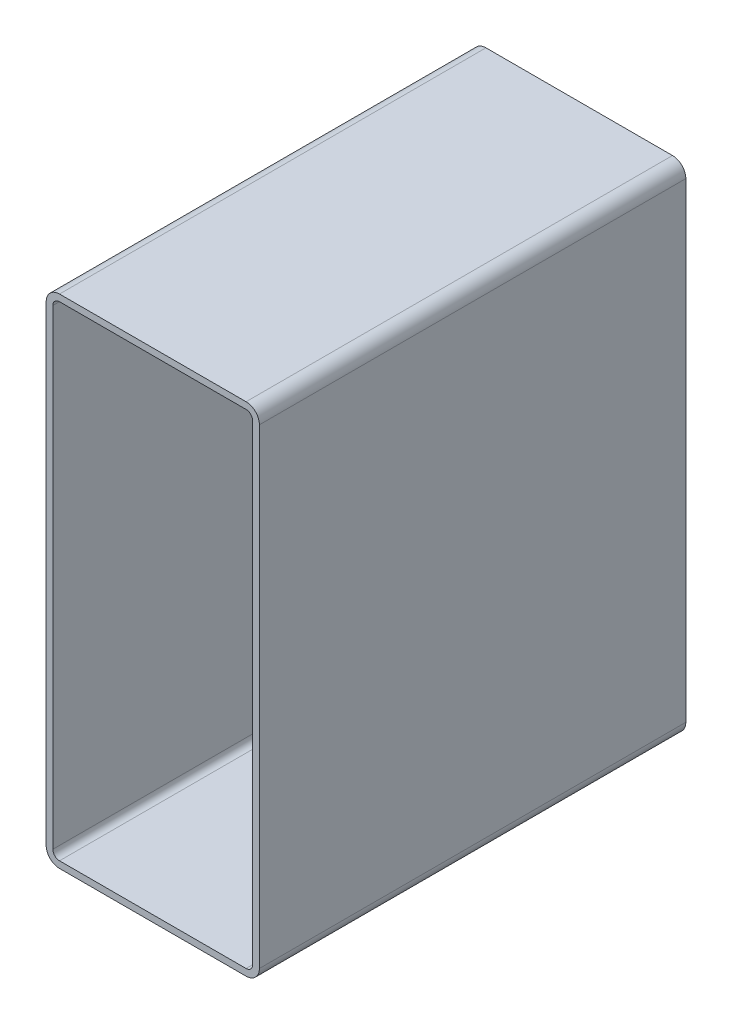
ISO-10303-21;
HEADER;
FILE_DESCRIPTION(('STEP AP214'),'2;1');
FILE_NAME('part.step','',(''),(''),'','','');
FILE_SCHEMA(('AUTOMOTIVE_DESIGN { 1 0 10303 214 1 1 1 1 }'));
ENDSEC;
DATA;
#1=APPLICATION_CONTEXT('core data for automotive mechanical design processes');
#2=APPLICATION_PROTOCOL_DEFINITION('international standard','automotive_design',2000,#1);
#3=PRODUCT_CONTEXT('',#1,'mechanical');
#4=PRODUCT('Part','Part','',(#3));
#5=PRODUCT_RELATED_PRODUCT_CATEGORY('part','',(#4));
#6=PRODUCT_DEFINITION_FORMATION('','',#4);
#7=PRODUCT_DEFINITION_CONTEXT('part definition',#1,'design');
#8=PRODUCT_DEFINITION('design','',#6,#7);
#9=PRODUCT_DEFINITION_SHAPE('','',#8);
#10=(LENGTH_UNIT() NAMED_UNIT(*) SI_UNIT(.MILLI.,.METRE.));
#11=(NAMED_UNIT(*) PLANE_ANGLE_UNIT() SI_UNIT($,.RADIAN.));
#12=(NAMED_UNIT(*) SI_UNIT($,.STERADIAN.) SOLID_ANGLE_UNIT());
#13=UNCERTAINTY_MEASURE_WITH_UNIT(LENGTH_MEASURE(1.E-05),#10,'distance_accuracy_value','');
#14=(GEOMETRIC_REPRESENTATION_CONTEXT(3) GLOBAL_UNCERTAINTY_ASSIGNED_CONTEXT((#13)) GLOBAL_UNIT_ASSIGNED_CONTEXT((#10,
#11,#12)) REPRESENTATION_CONTEXT('',''));
#15=CARTESIAN_POINT('',(0.,0.,0.));
#16=DIRECTION('',(0.,0.,1.));
#17=DIRECTION('',(1.,0.,0.));
#18=AXIS2_PLACEMENT_3D('',#15,#16,#17);
#19=CARTESIAN_POINT('',(9.57230139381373,347.903679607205,304.8));
#20=DIRECTION('',(0.,0.,1.));
#21=DIRECTION('',(1.,0.,0.));
#22=AXIS2_PLACEMENT_3D('',#19,#20,#21);
#23=PLANE('',#22);
#24=CARTESIAN_POINT('',(9.57230139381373,347.903679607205,304.8));
#25=DIRECTION('',(0.,0.,1.));
#26=DIRECTION('',(1.,0.,0.));
#27=AXIS2_PLACEMENT_3D('',#24,#25,#26);
#28=CIRCLE('',#27,9.52500000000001);
#29=CARTESIAN_POINT('',(9.57230139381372,357.428679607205,304.8));
#30=VERTEX_POINT('',#29);
#31=CARTESIAN_POINT('',(0.0473013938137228,347.903679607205,304.8));
#32=VERTEX_POINT('',#31);
#33=EDGE_CURVE('E211',#30,#32,#28,.T.);
#34=ORIENTED_EDGE('',*,*,#33,.T.);
#35=DIRECTION('',(0.,-1.,0.));
#36=VECTOR('',#35,1.);
#37=CARTESIAN_POINT('',(0.0473013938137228,11.3536796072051,304.8));
#38=LINE('',#37,#36);
#39=CARTESIAN_POINT('',(0.0473013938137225,11.3536796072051,304.8));
#40=VERTEX_POINT('',#39);
#41=EDGE_CURVE('E214',#32,#40,#38,.T.);
#42=ORIENTED_EDGE('',*,*,#41,.T.);
#43=CARTESIAN_POINT('',(9.57230139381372,11.3536796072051,304.8));
#44=DIRECTION('',(0.,0.,1.));
#45=DIRECTION('',(1.,0.,0.));
#46=AXIS2_PLACEMENT_3D('',#43,#44,#45);
#47=CIRCLE('',#46,9.525);
#48=CARTESIAN_POINT('',(9.57230139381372,1.82867960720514,304.8));
#49=VERTEX_POINT('',#48);
#50=EDGE_CURVE('E217',#40,#49,#47,.T.);
#51=ORIENTED_EDGE('',*,*,#50,.T.);
#52=DIRECTION('',(1.,0.,0.));
#53=VECTOR('',#52,1.);
#54=CARTESIAN_POINT('',(142.922301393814,1.82867960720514,304.8));
#55=LINE('',#54,#53);
#56=CARTESIAN_POINT('',(142.922301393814,1.82867960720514,304.8));
#57=VERTEX_POINT('',#56);
#58=EDGE_CURVE('E219',#49,#57,#55,.T.);
#59=ORIENTED_EDGE('',*,*,#58,.T.);
#60=CARTESIAN_POINT('',(142.922301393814,11.3536796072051,304.8));
#61=DIRECTION('',(0.,0.,1.));
#62=DIRECTION('',(1.,0.,0.));
#63=AXIS2_PLACEMENT_3D('',#60,#61,#62);
#64=CIRCLE('',#63,9.52500000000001);
#65=CARTESIAN_POINT('',(152.447301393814,11.3536796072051,304.8));
#66=VERTEX_POINT('',#65);
#67=EDGE_CURVE('E221',#57,#66,#64,.T.);
#68=ORIENTED_EDGE('',*,*,#67,.T.);
#69=DIRECTION('',(0.,1.,0.));
#70=VECTOR('',#69,1.);
#71=CARTESIAN_POINT('',(152.447301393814,347.903679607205,304.8));
#72=LINE('',#71,#70);
#73=CARTESIAN_POINT('',(152.447301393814,347.903679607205,304.8));
#74=VERTEX_POINT('',#73);
#75=EDGE_CURVE('E223',#66,#74,#72,.T.);
#76=ORIENTED_EDGE('',*,*,#75,.T.);
#77=CARTESIAN_POINT('',(142.922301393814,347.903679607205,304.8));
#78=DIRECTION('',(0.,0.,1.));
#79=DIRECTION('',(1.,0.,0.));
#80=AXIS2_PLACEMENT_3D('',#77,#78,#79);
#81=CIRCLE('',#80,9.52500000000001);
#82=CARTESIAN_POINT('',(142.922301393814,357.428679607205,304.8));
#83=VERTEX_POINT('',#82);
#84=EDGE_CURVE('E225',#74,#83,#81,.T.);
#85=ORIENTED_EDGE('',*,*,#84,.T.);
#86=DIRECTION('',(-1.,0.,0.));
#87=VECTOR('',#86,1.);
#88=CARTESIAN_POINT('',(9.57230139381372,357.428679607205,304.8));
#89=LINE('',#88,#87);
#90=EDGE_CURVE('E227',#83,#30,#89,.T.);
#91=ORIENTED_EDGE('',*,*,#90,.T.);
#92=EDGE_LOOP('',(#34,#42,#51,#59,#68,#76,#85,#91));
#93=FACE_BOUND('',#92,.T.);
#94=DIRECTION('',(0.,-1.,0.));
#95=VECTOR('',#94,1.);
#96=CARTESIAN_POINT('',(4.80980139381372,11.3536796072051,304.8));
#97=LINE('',#96,#95);
#98=CARTESIAN_POINT('',(4.80980139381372,347.903679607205,304.8));
#99=VERTEX_POINT('',#98);
#100=CARTESIAN_POINT('',(4.80980139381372,11.3536796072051,304.8));
#101=VERTEX_POINT('',#100);
#102=EDGE_CURVE('E154',#99,#101,#97,.T.);
#103=ORIENTED_EDGE('',*,*,#102,.F.);
#104=CARTESIAN_POINT('',(9.57230139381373,347.903679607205,304.8));
#105=DIRECTION('',(0.,0.,1.));
#106=DIRECTION('',(1.,0.,0.));
#107=AXIS2_PLACEMENT_3D('',#104,#105,#106);
#108=CIRCLE('',#107,4.7625);
#109=CARTESIAN_POINT('',(9.57230139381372,352.666179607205,304.8));
#110=VERTEX_POINT('',#109);
#111=EDGE_CURVE('E146',#110,#99,#108,.T.);
#112=ORIENTED_EDGE('',*,*,#111,.F.);
#113=DIRECTION('',(-1.,0.,0.));
#114=VECTOR('',#113,1.);
#115=CARTESIAN_POINT('',(9.57230139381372,352.666179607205,304.8));
#116=LINE('',#115,#114);
#117=CARTESIAN_POINT('',(142.922301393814,352.666179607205,304.8));
#118=VERTEX_POINT('',#117);
#119=EDGE_CURVE('E179',#118,#110,#116,.T.);
#120=ORIENTED_EDGE('',*,*,#119,.F.);
#121=CARTESIAN_POINT('',(142.922301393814,347.903679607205,304.8));
#122=DIRECTION('',(0.,0.,1.));
#123=DIRECTION('',(1.,0.,0.));
#124=AXIS2_PLACEMENT_3D('',#121,#122,#123);
#125=CIRCLE('',#124,4.7625);
#126=CARTESIAN_POINT('',(147.684801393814,347.903679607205,304.8));
#127=VERTEX_POINT('',#126);
#128=EDGE_CURVE('E177',#127,#118,#125,.T.);
#129=ORIENTED_EDGE('',*,*,#128,.F.);
#130=DIRECTION('',(0.,1.,0.));
#131=VECTOR('',#130,1.);
#132=CARTESIAN_POINT('',(147.684801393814,347.903679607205,304.8));
#133=LINE('',#132,#131);
#134=CARTESIAN_POINT('',(147.684801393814,11.3536796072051,304.8));
#135=VERTEX_POINT('',#134);
#136=EDGE_CURVE('E175',#135,#127,#133,.T.);
#137=ORIENTED_EDGE('',*,*,#136,.F.);
#138=CARTESIAN_POINT('',(142.922301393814,11.3536796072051,304.8));
#139=DIRECTION('',(0.,0.,1.));
#140=DIRECTION('',(1.,0.,0.));
#141=AXIS2_PLACEMENT_3D('',#138,#139,#140);
#142=CIRCLE('',#141,4.7625);
#143=CARTESIAN_POINT('',(142.922301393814,6.59117960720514,304.8));
#144=VERTEX_POINT('',#143);
#145=EDGE_CURVE('E173',#144,#135,#142,.T.);
#146=ORIENTED_EDGE('',*,*,#145,.F.);
#147=DIRECTION('',(1.,0.,0.));
#148=VECTOR('',#147,1.);
#149=CARTESIAN_POINT('',(142.922301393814,6.59117960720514,304.8));
#150=LINE('',#149,#148);
#151=CARTESIAN_POINT('',(9.57230139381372,6.59117960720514,304.8));
#152=VERTEX_POINT('',#151);
#153=EDGE_CURVE('E169',#152,#144,#150,.T.);
#154=ORIENTED_EDGE('',*,*,#153,.F.);
#155=CARTESIAN_POINT('',(9.57230139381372,11.3536796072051,304.8));
#156=DIRECTION('',(0.,0.,1.));
#157=DIRECTION('',(1.,0.,0.));
#158=AXIS2_PLACEMENT_3D('',#155,#156,#157);
#159=CIRCLE('',#158,4.7625);
#160=EDGE_CURVE('E167',#101,#152,#159,.T.);
#161=ORIENTED_EDGE('',*,*,#160,.F.);
#162=EDGE_LOOP('',(#103,#112,#120,#129,#137,#146,#154,#161));
#163=FACE_BOUND('',#162,.T.);
#164=ADVANCED_FACE('F33',(#93,#163),#23,.T.);
#165=CARTESIAN_POINT('',(9.57230139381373,347.903679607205,0.));
#166=DIRECTION('',(0.,0.,1.));
#167=DIRECTION('',(1.,0.,0.));
#168=AXIS2_PLACEMENT_3D('',#165,#166,#167);
#169=PLANE('',#168);
#170=CARTESIAN_POINT('',(9.57230139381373,347.903679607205,0.));
#171=DIRECTION('',(0.,0.,1.));
#172=DIRECTION('',(1.,0.,0.));
#173=AXIS2_PLACEMENT_3D('',#170,#171,#172);
#174=CIRCLE('',#173,9.52500000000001);
#175=CARTESIAN_POINT('',(9.57230139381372,357.428679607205,0.));
#176=VERTEX_POINT('',#175);
#177=CARTESIAN_POINT('',(0.0473013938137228,347.903679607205,0.));
#178=VERTEX_POINT('',#177);
#179=EDGE_CURVE('E162',#176,#178,#174,.T.);
#180=ORIENTED_EDGE('',*,*,#179,.F.);
#181=DIRECTION('',(-1.,0.,0.));
#182=VECTOR('',#181,1.);
#183=CARTESIAN_POINT('',(9.57230139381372,357.428679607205,0.));
#184=LINE('',#183,#182);
#185=CARTESIAN_POINT('',(142.922301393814,357.428679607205,0.));
#186=VERTEX_POINT('',#185);
#187=EDGE_CURVE('E215',#186,#176,#184,.T.);
#188=ORIENTED_EDGE('',*,*,#187,.F.);
#189=CARTESIAN_POINT('',(142.922301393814,347.903679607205,0.));
#190=DIRECTION('',(0.,0.,1.));
#191=DIRECTION('',(1.,0.,0.));
#192=AXIS2_PLACEMENT_3D('',#189,#190,#191);
#193=CIRCLE('',#192,9.52500000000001);
#194=CARTESIAN_POINT('',(152.447301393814,347.903679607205,0.));
#195=VERTEX_POINT('',#194);
#196=EDGE_CURVE('E242',#195,#186,#193,.T.);
#197=ORIENTED_EDGE('',*,*,#196,.F.);
#198=DIRECTION('',(0.,1.,0.));
#199=VECTOR('',#198,1.);
#200=CARTESIAN_POINT('',(152.447301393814,347.903679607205,0.));
#201=LINE('',#200,#199);
#202=CARTESIAN_POINT('',(152.447301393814,11.3536796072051,0.));
#203=VERTEX_POINT('',#202);
#204=EDGE_CURVE('E240',#203,#195,#201,.T.);
#205=ORIENTED_EDGE('',*,*,#204,.F.);
#206=CARTESIAN_POINT('',(142.922301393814,11.3536796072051,0.));
#207=DIRECTION('',(0.,0.,1.));
#208=DIRECTION('',(1.,0.,0.));
#209=AXIS2_PLACEMENT_3D('',#206,#207,#208);
#210=CIRCLE('',#209,9.52500000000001);
#211=CARTESIAN_POINT('',(142.922301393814,1.82867960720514,0.));
#212=VERTEX_POINT('',#211);
#213=EDGE_CURVE('E238',#212,#203,#210,.T.);
#214=ORIENTED_EDGE('',*,*,#213,.F.);
#215=DIRECTION('',(1.,0.,0.));
#216=VECTOR('',#215,1.);
#217=CARTESIAN_POINT('',(142.922301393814,1.82867960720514,0.));
#218=LINE('',#217,#216);
#219=CARTESIAN_POINT('',(9.57230139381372,1.82867960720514,0.));
#220=VERTEX_POINT('',#219);
#221=EDGE_CURVE('E236',#220,#212,#218,.T.);
#222=ORIENTED_EDGE('',*,*,#221,.F.);
#223=CARTESIAN_POINT('',(9.57230139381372,11.3536796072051,0.));
#224=DIRECTION('',(0.,0.,1.));
#225=DIRECTION('',(1.,0.,0.));
#226=AXIS2_PLACEMENT_3D('',#223,#224,#225);
#227=CIRCLE('',#226,9.525);
#228=CARTESIAN_POINT('',(0.0473013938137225,11.3536796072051,0.));
#229=VERTEX_POINT('',#228);
#230=EDGE_CURVE('E234',#229,#220,#227,.T.);
#231=ORIENTED_EDGE('',*,*,#230,.F.);
#232=DIRECTION('',(0.,-1.,0.));
#233=VECTOR('',#232,1.);
#234=CARTESIAN_POINT('',(0.0473013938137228,11.3536796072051,0.));
#235=LINE('',#234,#233);
#236=EDGE_CURVE('E232',#178,#229,#235,.T.);
#237=ORIENTED_EDGE('',*,*,#236,.F.);
#238=EDGE_LOOP('',(#180,#188,#197,#205,#214,#222,#231,#237));
#239=FACE_BOUND('',#238,.T.);
#240=CARTESIAN_POINT('',(9.57230139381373,347.903679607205,0.));
#241=DIRECTION('',(0.,0.,1.));
#242=DIRECTION('',(1.,0.,0.));
#243=AXIS2_PLACEMENT_3D('',#240,#241,#242);
#244=CIRCLE('',#243,4.7625);
#245=CARTESIAN_POINT('',(9.57230139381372,352.666179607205,0.));
#246=VERTEX_POINT('',#245);
#247=CARTESIAN_POINT('',(4.80980139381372,347.903679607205,0.));
#248=VERTEX_POINT('',#247);
#249=EDGE_CURVE('E56',#246,#248,#244,.T.);
#250=ORIENTED_EDGE('',*,*,#249,.T.);
#251=DIRECTION('',(0.,-1.,0.));
#252=VECTOR('',#251,1.);
#253=CARTESIAN_POINT('',(4.80980139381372,11.3536796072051,0.));
#254=LINE('',#253,#252);
#255=CARTESIAN_POINT('',(4.80980139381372,11.3536796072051,0.));
#256=VERTEX_POINT('',#255);
#257=EDGE_CURVE('E161',#248,#256,#254,.T.);
#258=ORIENTED_EDGE('',*,*,#257,.T.);
#259=CARTESIAN_POINT('',(9.57230139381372,11.3536796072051,0.));
#260=DIRECTION('',(0.,0.,1.));
#261=DIRECTION('',(1.,0.,0.));
#262=AXIS2_PLACEMENT_3D('',#259,#260,#261);
#263=CIRCLE('',#262,4.7625);
#264=CARTESIAN_POINT('',(9.57230139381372,6.59117960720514,0.));
#265=VERTEX_POINT('',#264);
#266=EDGE_CURVE('E183',#256,#265,#263,.T.);
#267=ORIENTED_EDGE('',*,*,#266,.T.);
#268=DIRECTION('',(1.,0.,0.));
#269=VECTOR('',#268,1.);
#270=CARTESIAN_POINT('',(142.922301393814,6.59117960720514,0.));
#271=LINE('',#270,#269);
#272=CARTESIAN_POINT('',(142.922301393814,6.59117960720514,0.));
#273=VERTEX_POINT('',#272);
#274=EDGE_CURVE('E186',#265,#273,#271,.T.);
#275=ORIENTED_EDGE('',*,*,#274,.T.);
#276=CARTESIAN_POINT('',(142.922301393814,11.3536796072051,0.));
#277=DIRECTION('',(0.,0.,1.));
#278=DIRECTION('',(1.,0.,0.));
#279=AXIS2_PLACEMENT_3D('',#276,#277,#278);
#280=CIRCLE('',#279,4.7625);
#281=CARTESIAN_POINT('',(147.684801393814,11.3536796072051,0.));
#282=VERTEX_POINT('',#281);
#283=EDGE_CURVE('E189',#273,#282,#280,.T.);
#284=ORIENTED_EDGE('',*,*,#283,.T.);
#285=DIRECTION('',(0.,1.,0.));
#286=VECTOR('',#285,1.);
#287=CARTESIAN_POINT('',(147.684801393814,347.903679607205,0.));
#288=LINE('',#287,#286);
#289=CARTESIAN_POINT('',(147.684801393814,347.903679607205,0.));
#290=VERTEX_POINT('',#289);
#291=EDGE_CURVE('E192',#282,#290,#288,.T.);
#292=ORIENTED_EDGE('',*,*,#291,.T.);
#293=CARTESIAN_POINT('',(142.922301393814,347.903679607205,0.));
#294=DIRECTION('',(0.,0.,1.));
#295=DIRECTION('',(1.,0.,0.));
#296=AXIS2_PLACEMENT_3D('',#293,#294,#295);
#297=CIRCLE('',#296,4.7625);
#298=CARTESIAN_POINT('',(142.922301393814,352.666179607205,0.));
#299=VERTEX_POINT('',#298);
#300=EDGE_CURVE('E195',#290,#299,#297,.T.);
#301=ORIENTED_EDGE('',*,*,#300,.T.);
#302=DIRECTION('',(-1.,0.,0.));
#303=VECTOR('',#302,1.);
#304=CARTESIAN_POINT('',(9.57230139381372,352.666179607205,0.));
#305=LINE('',#304,#303);
#306=EDGE_CURVE('E155',#299,#246,#305,.T.);
#307=ORIENTED_EDGE('',*,*,#306,.T.);
#308=EDGE_LOOP('',(#250,#258,#267,#275,#284,#292,#301,#307));
#309=FACE_BOUND('',#308,.T.);
#310=ADVANCED_FACE('F272',(#239,#309),#169,.F.);
#311=CARTESIAN_POINT('',(9.57230139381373,347.903679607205,304.8));
#312=DIRECTION('',(0.,0.,-1.));
#313=DIRECTION('',(-1.,0.,0.));
#314=AXIS2_PLACEMENT_3D('',#311,#312,#313);
#315=CYLINDRICAL_SURFACE('',#314,9.52500000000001);
#316=ORIENTED_EDGE('',*,*,#179,.T.);
#317=DIRECTION('',(0.,0.,-1.));
#318=VECTOR('',#317,1.);
#319=CARTESIAN_POINT('',(0.0473013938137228,347.903679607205,304.8));
#320=LINE('',#319,#318);
#321=EDGE_CURVE('E11',#32,#178,#320,.T.);
#322=ORIENTED_EDGE('',*,*,#321,.F.);
#323=ORIENTED_EDGE('',*,*,#33,.F.);
#324=DIRECTION('',(0.,0.,-1.));
#325=VECTOR('',#324,1.);
#326=CARTESIAN_POINT('',(9.57230139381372,357.428679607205,304.8));
#327=LINE('',#326,#325);
#328=EDGE_CURVE('E229',#30,#176,#327,.T.);
#329=ORIENTED_EDGE('',*,*,#328,.T.);
#330=EDGE_LOOP('',(#316,#322,#323,#329));
#331=FACE_BOUND('',#330,.T.);
#332=ADVANCED_FACE('F35',(#331),#315,.T.);
#333=CARTESIAN_POINT('',(0.0473013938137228,11.3536796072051,304.8));
#334=DIRECTION('',(1.,0.,0.));
#335=DIRECTION('',(0.,0.,-1.));
#336=AXIS2_PLACEMENT_3D('',#333,#334,#335);
#337=PLANE('',#336);
#338=ORIENTED_EDGE('',*,*,#236,.T.);
#339=DIRECTION('',(0.,0.,-1.));
#340=VECTOR('',#339,1.);
#341=CARTESIAN_POINT('',(0.0473013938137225,11.3536796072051,304.8));
#342=LINE('',#341,#340);
#343=EDGE_CURVE('E41',#40,#229,#342,.T.);
#344=ORIENTED_EDGE('',*,*,#343,.F.);
#345=ORIENTED_EDGE('',*,*,#41,.F.);
#346=ORIENTED_EDGE('',*,*,#321,.T.);
#347=EDGE_LOOP('',(#338,#344,#345,#346));
#348=FACE_BOUND('',#347,.T.);
#349=ADVANCED_FACE('F289',(#348),#337,.F.);
#350=CARTESIAN_POINT('',(9.57230139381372,11.3536796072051,304.8));
#351=DIRECTION('',(0.,0.,-1.));
#352=DIRECTION('',(-1.,0.,0.));
#353=AXIS2_PLACEMENT_3D('',#350,#351,#352);
#354=CYLINDRICAL_SURFACE('',#353,9.525);
#355=ORIENTED_EDGE('',*,*,#230,.T.);
#356=DIRECTION('',(0.,0.,-1.));
#357=VECTOR('',#356,1.);
#358=CARTESIAN_POINT('',(9.57230139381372,1.82867960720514,304.8));
#359=LINE('',#358,#357);
#360=EDGE_CURVE('E259',#49,#220,#359,.T.);
#361=ORIENTED_EDGE('',*,*,#360,.F.);
#362=ORIENTED_EDGE('',*,*,#50,.F.);
#363=ORIENTED_EDGE('',*,*,#343,.T.);
#364=EDGE_LOOP('',(#355,#361,#362,#363));
#365=FACE_BOUND('',#364,.T.);
#366=ADVANCED_FACE('F266',(#365),#354,.T.);
#367=CARTESIAN_POINT('',(142.922301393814,1.82867960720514,304.8));
#368=DIRECTION('',(0.,1.,0.));
#369=DIRECTION('',(0.,0.,1.));
#370=AXIS2_PLACEMENT_3D('',#367,#368,#369);
#371=PLANE('',#370);
#372=ORIENTED_EDGE('',*,*,#221,.T.);
#373=DIRECTION('',(0.,0.,-1.));
#374=VECTOR('',#373,1.);
#375=CARTESIAN_POINT('',(142.922301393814,1.82867960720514,304.8));
#376=LINE('',#375,#374);
#377=EDGE_CURVE('E256',#57,#212,#376,.T.);
#378=ORIENTED_EDGE('',*,*,#377,.F.);
#379=ORIENTED_EDGE('',*,*,#58,.F.);
#380=ORIENTED_EDGE('',*,*,#360,.T.);
#381=EDGE_LOOP('',(#372,#378,#379,#380));
#382=FACE_BOUND('',#381,.T.);
#383=ADVANCED_FACE('F278',(#382),#371,.F.);
#384=CARTESIAN_POINT('',(142.922301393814,11.3536796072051,304.8));
#385=DIRECTION('',(0.,0.,-1.));
#386=DIRECTION('',(-1.,0.,0.));
#387=AXIS2_PLACEMENT_3D('',#384,#385,#386);
#388=CYLINDRICAL_SURFACE('',#387,9.52500000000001);
#389=ORIENTED_EDGE('',*,*,#213,.T.);
#390=DIRECTION('',(0.,0.,-1.));
#391=VECTOR('',#390,1.);
#392=CARTESIAN_POINT('',(152.447301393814,11.3536796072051,304.8));
#393=LINE('',#392,#391);
#394=EDGE_CURVE('E253',#66,#203,#393,.T.);
#395=ORIENTED_EDGE('',*,*,#394,.F.);
#396=ORIENTED_EDGE('',*,*,#67,.F.);
#397=ORIENTED_EDGE('',*,*,#377,.T.);
#398=EDGE_LOOP('',(#389,#395,#396,#397));
#399=FACE_BOUND('',#398,.T.);
#400=ADVANCED_FACE('F282',(#399),#388,.T.);
#401=CARTESIAN_POINT('',(152.447301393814,347.903679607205,304.8));
#402=DIRECTION('',(-1.,0.,0.));
#403=DIRECTION('',(0.,0.,1.));
#404=AXIS2_PLACEMENT_3D('',#401,#402,#403);
#405=PLANE('',#404);
#406=ORIENTED_EDGE('',*,*,#204,.T.);
#407=DIRECTION('',(0.,0.,-1.));
#408=VECTOR('',#407,1.);
#409=CARTESIAN_POINT('',(152.447301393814,347.903679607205,304.8));
#410=LINE('',#409,#408);
#411=EDGE_CURVE('E250',#74,#195,#410,.T.);
#412=ORIENTED_EDGE('',*,*,#411,.F.);
#413=ORIENTED_EDGE('',*,*,#75,.F.);
#414=ORIENTED_EDGE('',*,*,#394,.T.);
#415=EDGE_LOOP('',(#406,#412,#413,#414));
#416=FACE_BOUND('',#415,.T.);
#417=ADVANCED_FACE('F302',(#416),#405,.F.);
#418=CARTESIAN_POINT('',(142.922301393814,347.903679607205,304.8));
#419=DIRECTION('',(0.,0.,-1.));
#420=DIRECTION('',(-1.,0.,0.));
#421=AXIS2_PLACEMENT_3D('',#418,#419,#420);
#422=CYLINDRICAL_SURFACE('',#421,9.52500000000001);
#423=ORIENTED_EDGE('',*,*,#196,.T.);
#424=DIRECTION('',(0.,0.,-1.));
#425=VECTOR('',#424,1.);
#426=CARTESIAN_POINT('',(142.922301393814,357.428679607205,304.8));
#427=LINE('',#426,#425);
#428=EDGE_CURVE('E247',#83,#186,#427,.T.);
#429=ORIENTED_EDGE('',*,*,#428,.F.);
#430=ORIENTED_EDGE('',*,*,#84,.F.);
#431=ORIENTED_EDGE('',*,*,#411,.T.);
#432=EDGE_LOOP('',(#423,#429,#430,#431));
#433=FACE_BOUND('',#432,.T.);
#434=ADVANCED_FACE('F300',(#433),#422,.T.);
#435=CARTESIAN_POINT('',(9.57230139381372,357.428679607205,304.8));
#436=DIRECTION('',(0.,-1.,0.));
#437=DIRECTION('',(0.,0.,-1.));
#438=AXIS2_PLACEMENT_3D('',#435,#436,#437);
#439=PLANE('',#438);
#440=ORIENTED_EDGE('',*,*,#187,.T.);
#441=ORIENTED_EDGE('',*,*,#328,.F.);
#442=ORIENTED_EDGE('',*,*,#90,.F.);
#443=ORIENTED_EDGE('',*,*,#428,.T.);
#444=EDGE_LOOP('',(#440,#441,#442,#443));
#445=FACE_BOUND('',#444,.T.);
#446=ADVANCED_FACE('F295',(#445),#439,.F.);
#447=CARTESIAN_POINT('',(9.57230139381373,347.903679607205,304.8));
#448=DIRECTION('',(0.,0.,-1.));
#449=DIRECTION('',(-1.,0.,0.));
#450=AXIS2_PLACEMENT_3D('',#447,#448,#449);
#451=CYLINDRICAL_SURFACE('',#450,4.7625);
#452=ORIENTED_EDGE('',*,*,#249,.F.);
#453=DIRECTION('',(0.,0.,-1.));
#454=VECTOR('',#453,1.);
#455=CARTESIAN_POINT('',(9.57230139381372,352.666179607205,304.8));
#456=LINE('',#455,#454);
#457=EDGE_CURVE('E150',#110,#246,#456,.T.);
#458=ORIENTED_EDGE('',*,*,#457,.F.);
#459=ORIENTED_EDGE('',*,*,#111,.T.);
#460=DIRECTION('',(0.,0.,-1.));
#461=VECTOR('',#460,1.);
#462=CARTESIAN_POINT('',(4.80980139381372,347.903679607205,304.8));
#463=LINE('',#462,#461);
#464=EDGE_CURVE('E149',#99,#248,#463,.T.);
#465=ORIENTED_EDGE('',*,*,#464,.T.);
#466=EDGE_LOOP('',(#452,#458,#459,#465));
#467=FACE_BOUND('',#466,.T.);
#468=ADVANCED_FACE('F148',(#467),#451,.F.);
#469=CARTESIAN_POINT('',(4.80980139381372,11.3536796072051,304.8));
#470=DIRECTION('',(1.,0.,0.));
#471=DIRECTION('',(0.,0.,-1.));
#472=AXIS2_PLACEMENT_3D('',#469,#470,#471);
#473=PLANE('',#472);
#474=ORIENTED_EDGE('',*,*,#257,.F.);
#475=ORIENTED_EDGE('',*,*,#464,.F.);
#476=ORIENTED_EDGE('',*,*,#102,.T.);
#477=DIRECTION('',(0.,0.,-1.));
#478=VECTOR('',#477,1.);
#479=CARTESIAN_POINT('',(4.80980139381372,11.3536796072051,304.8));
#480=LINE('',#479,#478);
#481=EDGE_CURVE('E163',#101,#256,#480,.T.);
#482=ORIENTED_EDGE('',*,*,#481,.T.);
#483=EDGE_LOOP('',(#474,#475,#476,#482));
#484=FACE_BOUND('',#483,.T.);
#485=ADVANCED_FACE('F158',(#484),#473,.T.);
#486=CARTESIAN_POINT('',(9.57230139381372,11.3536796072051,304.8));
#487=DIRECTION('',(0.,0.,-1.));
#488=DIRECTION('',(-1.,0.,0.));
#489=AXIS2_PLACEMENT_3D('',#486,#487,#488);
#490=CYLINDRICAL_SURFACE('',#489,4.7625);
#491=ORIENTED_EDGE('',*,*,#266,.F.);
#492=ORIENTED_EDGE('',*,*,#481,.F.);
#493=ORIENTED_EDGE('',*,*,#160,.T.);
#494=DIRECTION('',(0.,0.,-1.));
#495=VECTOR('',#494,1.);
#496=CARTESIAN_POINT('',(9.57230139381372,6.59117960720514,304.8));
#497=LINE('',#496,#495);
#498=EDGE_CURVE('E208',#152,#265,#497,.T.);
#499=ORIENTED_EDGE('',*,*,#498,.T.);
#500=EDGE_LOOP('',(#491,#492,#493,#499));
#501=FACE_BOUND('',#500,.T.);
#502=ADVANCED_FACE('F327',(#501),#490,.F.);
#503=CARTESIAN_POINT('',(142.922301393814,6.59117960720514,304.8));
#504=DIRECTION('',(0.,1.,0.));
#505=DIRECTION('',(0.,0.,1.));
#506=AXIS2_PLACEMENT_3D('',#503,#504,#505);
#507=PLANE('',#506);
#508=ORIENTED_EDGE('',*,*,#274,.F.);
#509=ORIENTED_EDGE('',*,*,#498,.F.);
#510=ORIENTED_EDGE('',*,*,#153,.T.);
#511=DIRECTION('',(0.,0.,-1.));
#512=VECTOR('',#511,1.);
#513=CARTESIAN_POINT('',(142.922301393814,6.59117960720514,304.8));
#514=LINE('',#513,#512);
#515=EDGE_CURVE('E206',#144,#273,#514,.T.);
#516=ORIENTED_EDGE('',*,*,#515,.T.);
#517=EDGE_LOOP('',(#508,#509,#510,#516));
#518=FACE_BOUND('',#517,.T.);
#519=ADVANCED_FACE('F331',(#518),#507,.T.);
#520=CARTESIAN_POINT('',(142.922301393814,11.3536796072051,304.8));
#521=DIRECTION('',(0.,0.,-1.));
#522=DIRECTION('',(-1.,0.,0.));
#523=AXIS2_PLACEMENT_3D('',#520,#521,#522);
#524=CYLINDRICAL_SURFACE('',#523,4.7625);
#525=ORIENTED_EDGE('',*,*,#283,.F.);
#526=ORIENTED_EDGE('',*,*,#515,.F.);
#527=ORIENTED_EDGE('',*,*,#145,.T.);
#528=DIRECTION('',(0.,0.,-1.));
#529=VECTOR('',#528,1.);
#530=CARTESIAN_POINT('',(147.684801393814,11.3536796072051,304.8));
#531=LINE('',#530,#529);
#532=EDGE_CURVE('E204',#135,#282,#531,.T.);
#533=ORIENTED_EDGE('',*,*,#532,.T.);
#534=EDGE_LOOP('',(#525,#526,#527,#533));
#535=FACE_BOUND('',#534,.T.);
#536=ADVANCED_FACE('F337',(#535),#524,.F.);
#537=CARTESIAN_POINT('',(147.684801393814,347.903679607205,304.8));
#538=DIRECTION('',(-1.,0.,0.));
#539=DIRECTION('',(0.,0.,1.));
#540=AXIS2_PLACEMENT_3D('',#537,#538,#539);
#541=PLANE('',#540);
#542=ORIENTED_EDGE('',*,*,#291,.F.);
#543=ORIENTED_EDGE('',*,*,#532,.F.);
#544=ORIENTED_EDGE('',*,*,#136,.T.);
#545=DIRECTION('',(0.,0.,-1.));
#546=VECTOR('',#545,1.);
#547=CARTESIAN_POINT('',(147.684801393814,347.903679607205,304.8));
#548=LINE('',#547,#546);
#549=EDGE_CURVE('E202',#127,#290,#548,.T.);
#550=ORIENTED_EDGE('',*,*,#549,.T.);
#551=EDGE_LOOP('',(#542,#543,#544,#550));
#552=FACE_BOUND('',#551,.T.);
#553=ADVANCED_FACE('F341',(#552),#541,.T.);
#554=CARTESIAN_POINT('',(142.922301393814,347.903679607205,304.8));
#555=DIRECTION('',(0.,0.,-1.));
#556=DIRECTION('',(-1.,0.,0.));
#557=AXIS2_PLACEMENT_3D('',#554,#555,#556);
#558=CYLINDRICAL_SURFACE('',#557,4.7625);
#559=ORIENTED_EDGE('',*,*,#300,.F.);
#560=ORIENTED_EDGE('',*,*,#549,.F.);
#561=ORIENTED_EDGE('',*,*,#128,.T.);
#562=DIRECTION('',(0.,0.,-1.));
#563=VECTOR('',#562,1.);
#564=CARTESIAN_POINT('',(142.922301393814,352.666179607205,304.8));
#565=LINE('',#564,#563);
#566=EDGE_CURVE('E48',#118,#299,#565,.T.);
#567=ORIENTED_EDGE('',*,*,#566,.T.);
#568=EDGE_LOOP('',(#559,#560,#561,#567));
#569=FACE_BOUND('',#568,.T.);
#570=ADVANCED_FACE('F345',(#569),#558,.F.);
#571=CARTESIAN_POINT('',(9.57230139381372,352.666179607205,304.8));
#572=DIRECTION('',(0.,-1.,0.));
#573=DIRECTION('',(0.,0.,-1.));
#574=AXIS2_PLACEMENT_3D('',#571,#572,#573);
#575=PLANE('',#574);
#576=ORIENTED_EDGE('',*,*,#306,.F.);
#577=ORIENTED_EDGE('',*,*,#566,.F.);
#578=ORIENTED_EDGE('',*,*,#119,.T.);
#579=ORIENTED_EDGE('',*,*,#457,.T.);
#580=EDGE_LOOP('',(#576,#577,#578,#579));
#581=FACE_BOUND('',#580,.T.);
#582=ADVANCED_FACE('F349',(#581),#575,.T.);
#583=CLOSED_SHELL('',(#164,#310,#332,#349,#366,#383,#400,#417,#434,#446,#468,#485,#502,#519,
#536,#553,#570,#582));
#584=MANIFOLD_SOLID_BREP('B2',#583);
#585=ADVANCED_BREP_SHAPE_REPRESENTATION('',(#18,#584),#14);
#586=SHAPE_DEFINITION_REPRESENTATION(#9,#585);
ENDSEC;
END-ISO-10303-21;
